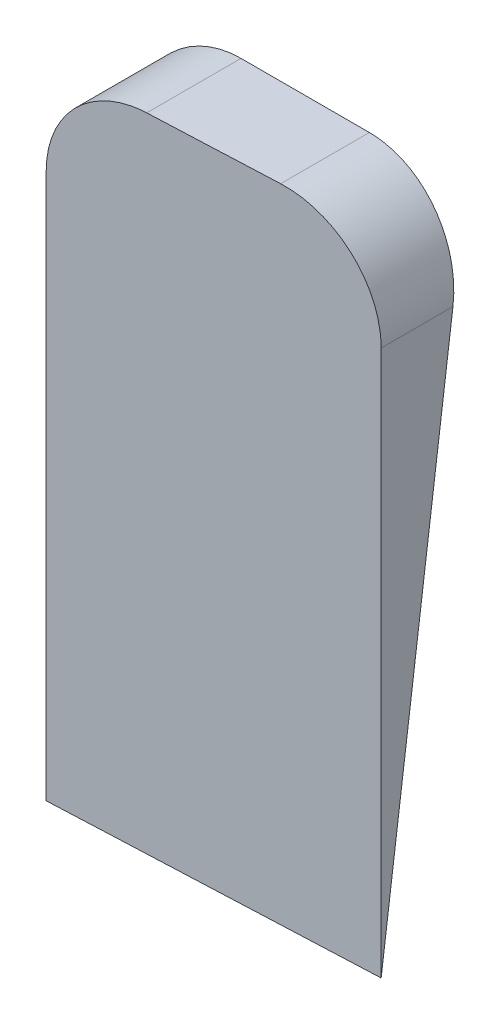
ISO-10303-21;
HEADER;
FILE_DESCRIPTION(('STEP AP214'),'2;1');
FILE_NAME('part.step','',(''),(''),'','','');
FILE_SCHEMA(('AUTOMOTIVE_DESIGN { 1 0 10303 214 1 1 1 1 }'));
ENDSEC;
DATA;
#1=APPLICATION_CONTEXT('core data for automotive mechanical design processes');
#2=APPLICATION_PROTOCOL_DEFINITION('international standard','automotive_design',2000,#1);
#3=PRODUCT_CONTEXT('',#1,'mechanical');
#4=PRODUCT('Part','Part','',(#3));
#5=PRODUCT_RELATED_PRODUCT_CATEGORY('part','',(#4));
#6=PRODUCT_DEFINITION_FORMATION('','',#4);
#7=PRODUCT_DEFINITION_CONTEXT('part definition',#1,'design');
#8=PRODUCT_DEFINITION('design','',#6,#7);
#9=PRODUCT_DEFINITION_SHAPE('','',#8);
#10=(LENGTH_UNIT() NAMED_UNIT(*) SI_UNIT(.MILLI.,.METRE.));
#11=(NAMED_UNIT(*) PLANE_ANGLE_UNIT() SI_UNIT($,.RADIAN.));
#12=(NAMED_UNIT(*) SI_UNIT($,.STERADIAN.) SOLID_ANGLE_UNIT());
#13=UNCERTAINTY_MEASURE_WITH_UNIT(LENGTH_MEASURE(1.E-05),#10,'distance_accuracy_value','');
#14=(GEOMETRIC_REPRESENTATION_CONTEXT(3) GLOBAL_UNCERTAINTY_ASSIGNED_CONTEXT((#13)) GLOBAL_UNIT_ASSIGNED_CONTEXT((#10,
#11,#12)) REPRESENTATION_CONTEXT('',''));
#15=CARTESIAN_POINT('',(0.,0.,0.));
#16=DIRECTION('',(0.,0.,1.));
#17=DIRECTION('',(1.,0.,0.));
#18=AXIS2_PLACEMENT_3D('',#15,#16,#17);
#19=CARTESIAN_POINT('',(0.,0.,25.));
#20=DIRECTION('',(1.,0.,0.));
#21=DIRECTION('',(0.,0.,-1.));
#22=AXIS2_PLACEMENT_3D('',#19,#20,#21);
#23=PLANE('',#22);
#24=DIRECTION('',(0.,0.,-1.));
#25=VECTOR('',#24,1.);
#26=CARTESIAN_POINT('',(0.,0.,25.));
#27=LINE('',#26,#25);
#28=CARTESIAN_POINT('',(0.,0.,3.06965938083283));
#29=VERTEX_POINT('',#28);
#30=CARTESIAN_POINT('',(0.,0.,2.63304995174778));
#31=VERTEX_POINT('',#30);
#32=EDGE_CURVE('E40',#29,#31,#27,.T.);
#33=ORIENTED_EDGE('',*,*,#32,.F.);
#34=DIRECTION('',(0.,-1.,0.));
#35=VECTOR('',#34,1.);
#36=CARTESIAN_POINT('',(0.,20.,3.06965938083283));
#37=LINE('',#36,#35);
#38=CARTESIAN_POINT('',(0.,17.,3.06965938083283));
#39=VERTEX_POINT('',#38);
#40=EDGE_CURVE('E80',#39,#29,#37,.T.);
#41=ORIENTED_EDGE('',*,*,#40,.F.);
#42=DIRECTION('',(0.,0.,-1.));
#43=VECTOR('',#42,1.);
#44=CARTESIAN_POINT('',(0.,17.,25.));
#45=LINE('',#44,#43);
#46=CARTESIAN_POINT('',(0.,17.,0.394957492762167));
#47=VERTEX_POINT('',#46);
#48=EDGE_CURVE('E105',#39,#47,#45,.T.);
#49=ORIENTED_EDGE('',*,*,#48,.T.);
#50=DIRECTION('',(0.,0.991444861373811,-0.130526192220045));
#51=VECTOR('',#50,1.);
#52=CARTESIAN_POINT('',(0.,20.,0.));
#53=LINE('',#52,#51);
#54=EDGE_CURVE('E98',#31,#47,#53,.T.);
#55=ORIENTED_EDGE('',*,*,#54,.F.);
#56=EDGE_LOOP('',(#33,#41,#49,#55));
#57=FACE_BOUND('',#56,.T.);
#58=ADVANCED_FACE('F33',(#57),#23,.F.);
#59=CARTESIAN_POINT('',(0.,0.,25.));
#60=DIRECTION('',(0.,1.,0.));
#61=DIRECTION('',(0.,0.,1.));
#62=AXIS2_PLACEMENT_3D('',#59,#60,#61);
#63=PLANE('',#62);
#64=DIRECTION('',(-1.,0.,0.));
#65=VECTOR('',#64,1.);
#66=CARTESIAN_POINT('',(10.,0.,2.63304995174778));
#67=LINE('',#66,#65);
#68=CARTESIAN_POINT('',(10.,0.,2.63304995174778));
#69=VERTEX_POINT('',#68);
#70=EDGE_CURVE('E94',#69,#31,#67,.T.);
#71=ORIENTED_EDGE('',*,*,#70,.F.);
#72=DIRECTION('',(0.999048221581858,0.,-0.0436193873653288));
#73=VECTOR('',#72,1.);
#74=CARTESIAN_POINT('',(0.,0.,3.06965938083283));
#75=LINE('',#74,#73);
#76=EDGE_CURVE('E83',#29,#69,#75,.T.);
#77=ORIENTED_EDGE('',*,*,#76,.F.);
#78=ORIENTED_EDGE('',*,*,#32,.T.);
#79=EDGE_LOOP('',(#71,#77,#78));
#80=FACE_BOUND('',#79,.T.);
#81=ADVANCED_FACE('F92',(#80),#63,.F.);
#82=CARTESIAN_POINT('',(10.,0.,25.));
#83=DIRECTION('',(-1.,0.,0.));
#84=DIRECTION('',(0.,0.,1.));
#85=AXIS2_PLACEMENT_3D('',#82,#83,#84);
#86=PLANE('',#85);
#87=DIRECTION('',(0.,0.,-1.));
#88=VECTOR('',#87,1.);
#89=CARTESIAN_POINT('',(10.,17.,25.));
#90=LINE('',#89,#88);
#91=CARTESIAN_POINT('',(10.,17.,2.63304995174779));
#92=VERTEX_POINT('',#91);
#93=CARTESIAN_POINT('',(10.,17.,0.394957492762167));
#94=VERTEX_POINT('',#93);
#95=EDGE_CURVE('E99',#92,#94,#90,.T.);
#96=ORIENTED_EDGE('',*,*,#95,.F.);
#97=DIRECTION('',(0.,-1.,0.));
#98=VECTOR('',#97,1.);
#99=CARTESIAN_POINT('',(10.,20.,2.63304995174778));
#100=LINE('',#99,#98);
#101=EDGE_CURVE('E88',#92,#69,#100,.T.);
#102=ORIENTED_EDGE('',*,*,#101,.T.);
#103=DIRECTION('',(0.,0.991444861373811,-0.130526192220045));
#104=VECTOR('',#103,1.);
#105=CARTESIAN_POINT('',(10.,20.,0.));
#106=LINE('',#105,#104);
#107=EDGE_CURVE('E116',#69,#94,#106,.T.);
#108=ORIENTED_EDGE('',*,*,#107,.T.);
#109=EDGE_LOOP('',(#96,#102,#108));
#110=FACE_BOUND('',#109,.T.);
#111=ADVANCED_FACE('F136',(#110),#86,.F.);
#112=CARTESIAN_POINT('',(7.,17.,25.));
#113=DIRECTION('',(0.,0.,-1.));
#114=DIRECTION('',(-1.,0.,0.));
#115=AXIS2_PLACEMENT_3D('',#112,#113,#114);
#116=CYLINDRICAL_SURFACE('',#115,3.);
#117=DIRECTION('',(0.,0.,-1.));
#118=VECTOR('',#117,1.);
#119=CARTESIAN_POINT('',(6.99999999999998,20.,25.));
#120=LINE('',#119,#118);
#121=CARTESIAN_POINT('',(6.99999999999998,20.,2.7640327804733));
#122=VERTEX_POINT('',#121);
#123=CARTESIAN_POINT('',(6.99999999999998,20.,0.));
#124=VERTEX_POINT('',#123);
#125=EDGE_CURVE('E100',#122,#124,#120,.T.);
#126=ORIENTED_EDGE('',*,*,#125,.F.);
#127=CARTESIAN_POINT('',(7.,17.,2.7640327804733));
#128=DIRECTION('',(-0.0436193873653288,0.,-0.999048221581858));
#129=DIRECTION('',(0.999048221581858,0.,-0.0436193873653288));
#130=AXIS2_PLACEMENT_3D('',#127,#128,#129);
#131=ELLIPSE('',#130,3.00285805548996,3.);
#132=EDGE_CURVE('E118',#122,#92,#131,.T.);
#133=ORIENTED_EDGE('',*,*,#132,.T.);
#134=ORIENTED_EDGE('',*,*,#95,.T.);
#135=CARTESIAN_POINT('',(7.,17.,0.394957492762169));
#136=DIRECTION('',(0.,0.130526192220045,0.991444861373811));
#137=DIRECTION('',(0.,0.991444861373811,-0.130526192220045));
#138=AXIS2_PLACEMENT_3D('',#135,#136,#137);
#139=ELLIPSE('',#138,3.02588688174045,3.);
#140=EDGE_CURVE('E110',#94,#124,#139,.T.);
#141=ORIENTED_EDGE('',*,*,#140,.T.);
#142=EDGE_LOOP('',(#126,#133,#134,#141));
#143=FACE_BOUND('',#142,.T.);
#144=ADVANCED_FACE('F129',(#143),#116,.T.);
#145=CARTESIAN_POINT('',(3.00000000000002,20.,25.));
#146=DIRECTION('',(0.,-1.,0.));
#147=DIRECTION('',(0.,0.,-1.));
#148=AXIS2_PLACEMENT_3D('',#145,#146,#147);
#149=PLANE('',#148);
#150=DIRECTION('',(0.,0.,-1.));
#151=VECTOR('',#150,1.);
#152=CARTESIAN_POINT('',(3.00000000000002,20.,25.));
#153=LINE('',#152,#151);
#154=CARTESIAN_POINT('',(3.00000000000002,20.,2.93867655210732));
#155=VERTEX_POINT('',#154);
#156=CARTESIAN_POINT('',(3.00000000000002,20.,0.));
#157=VERTEX_POINT('',#156);
#158=EDGE_CURVE('E53',#155,#157,#153,.T.);
#159=ORIENTED_EDGE('',*,*,#158,.F.);
#160=DIRECTION('',(0.999048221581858,0.,-0.0436193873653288));
#161=VECTOR('',#160,1.);
#162=CARTESIAN_POINT('',(0.,20.,3.06965938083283));
#163=LINE('',#162,#161);
#164=EDGE_CURVE('E47',#155,#122,#163,.T.);
#165=ORIENTED_EDGE('',*,*,#164,.T.);
#166=ORIENTED_EDGE('',*,*,#125,.T.);
#167=DIRECTION('',(-1.,0.,0.));
#168=VECTOR('',#167,1.);
#169=CARTESIAN_POINT('',(3.00000000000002,20.,0.));
#170=LINE('',#169,#168);
#171=EDGE_CURVE('E107',#124,#157,#170,.T.);
#172=ORIENTED_EDGE('',*,*,#171,.T.);
#173=EDGE_LOOP('',(#159,#165,#166,#172));
#174=FACE_BOUND('',#173,.T.);
#175=ADVANCED_FACE('F126',(#174),#149,.F.);
#176=CARTESIAN_POINT('',(3.,17.,25.));
#177=DIRECTION('',(0.,0.,-1.));
#178=DIRECTION('',(-1.,0.,0.));
#179=AXIS2_PLACEMENT_3D('',#176,#177,#178);
#180=CYLINDRICAL_SURFACE('',#179,3.);
#181=ORIENTED_EDGE('',*,*,#48,.F.);
#182=CARTESIAN_POINT('',(3.,17.,2.93867655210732));
#183=DIRECTION('',(-0.0436193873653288,0.,-0.999048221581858));
#184=DIRECTION('',(0.999048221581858,0.,-0.0436193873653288));
#185=AXIS2_PLACEMENT_3D('',#182,#183,#184);
#186=ELLIPSE('',#185,3.00285805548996,3.);
#187=EDGE_CURVE('E11',#39,#155,#186,.T.);
#188=ORIENTED_EDGE('',*,*,#187,.T.);
#189=ORIENTED_EDGE('',*,*,#158,.T.);
#190=CARTESIAN_POINT('',(3.,17.,0.394957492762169));
#191=DIRECTION('',(0.,0.130526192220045,0.991444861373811));
#192=DIRECTION('',(0.,0.991444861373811,-0.130526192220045));
#193=AXIS2_PLACEMENT_3D('',#190,#191,#192);
#194=ELLIPSE('',#193,3.02588688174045,3.);
#195=EDGE_CURVE('E113',#157,#47,#194,.T.);
#196=ORIENTED_EDGE('',*,*,#195,.T.);
#197=EDGE_LOOP('',(#181,#188,#189,#196));
#198=FACE_BOUND('',#197,.T.);
#199=ADVANCED_FACE('F170',(#198),#180,.T.);
#200=CARTESIAN_POINT('',(10.,20.,0.));
#201=DIRECTION('',(0.,0.130526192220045,0.991444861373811));
#202=DIRECTION('',(0.,-0.991444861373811,0.130526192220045));
#203=AXIS2_PLACEMENT_3D('',#200,#201,#202);
#204=PLANE('',#203);
#205=ORIENTED_EDGE('',*,*,#107,.F.);
#206=ORIENTED_EDGE('',*,*,#70,.T.);
#207=ORIENTED_EDGE('',*,*,#54,.T.);
#208=ORIENTED_EDGE('',*,*,#195,.F.);
#209=ORIENTED_EDGE('',*,*,#171,.F.);
#210=ORIENTED_EDGE('',*,*,#140,.F.);
#211=EDGE_LOOP('',(#205,#206,#207,#208,#209,#210));
#212=FACE_BOUND('',#211,.T.);
#213=ADVANCED_FACE('F134',(#212),#204,.F.);
#214=CARTESIAN_POINT('',(0.,20.,3.06965938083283));
#215=DIRECTION('',(-0.0436193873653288,0.,-0.999048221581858));
#216=DIRECTION('',(-0.999048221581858,0.,0.0436193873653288));
#217=AXIS2_PLACEMENT_3D('',#214,#215,#216);
#218=PLANE('',#217);
#219=ORIENTED_EDGE('',*,*,#164,.F.);
#220=ORIENTED_EDGE('',*,*,#187,.F.);
#221=ORIENTED_EDGE('',*,*,#40,.T.);
#222=ORIENTED_EDGE('',*,*,#76,.T.);
#223=ORIENTED_EDGE('',*,*,#101,.F.);
#224=ORIENTED_EDGE('',*,*,#132,.F.);
#225=EDGE_LOOP('',(#219,#220,#221,#222,#223,#224));
#226=FACE_BOUND('',#225,.T.);
#227=ADVANCED_FACE('F82',(#226),#218,.F.);
#228=CLOSED_SHELL('',(#58,#81,#111,#144,#175,#199,#213,#227));
#229=MANIFOLD_SOLID_BREP('B2',#228);
#230=ADVANCED_BREP_SHAPE_REPRESENTATION('',(#18,#229),#14);
#231=SHAPE_DEFINITION_REPRESENTATION(#9,#230);
ENDSEC;
END-ISO-10303-21;
